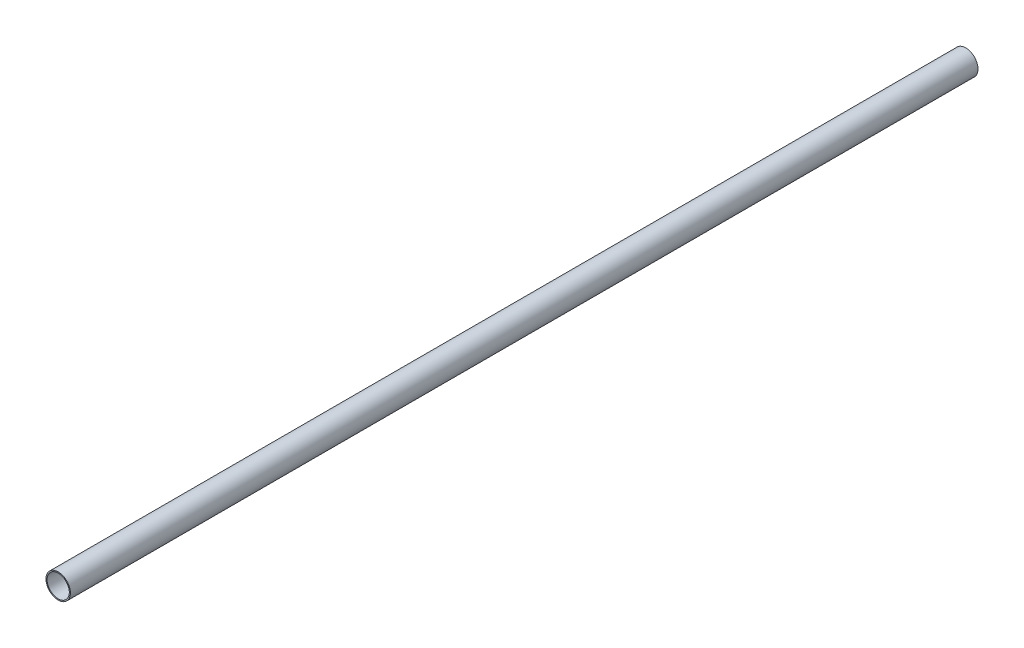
from build123d import *

# Parameters (mm, degrees)
ESQUISSE1_R      = 3.3
ESQUISSE1_R_2    = 3
EXTRUSION1_DEPTH = 122.5


with BuildPart() as part:
    # Esquisse1 → Extrusion1 (new, symmetric)
    with BuildSketch(Plane.XY):
        Circle(ESQUISSE1_R)
        Circle(ESQUISSE1_R_2, mode=Mode.SUBTRACT)
    extrude(amount=EXTRUSION1_DEPTH, both=True)


solid = part.part
